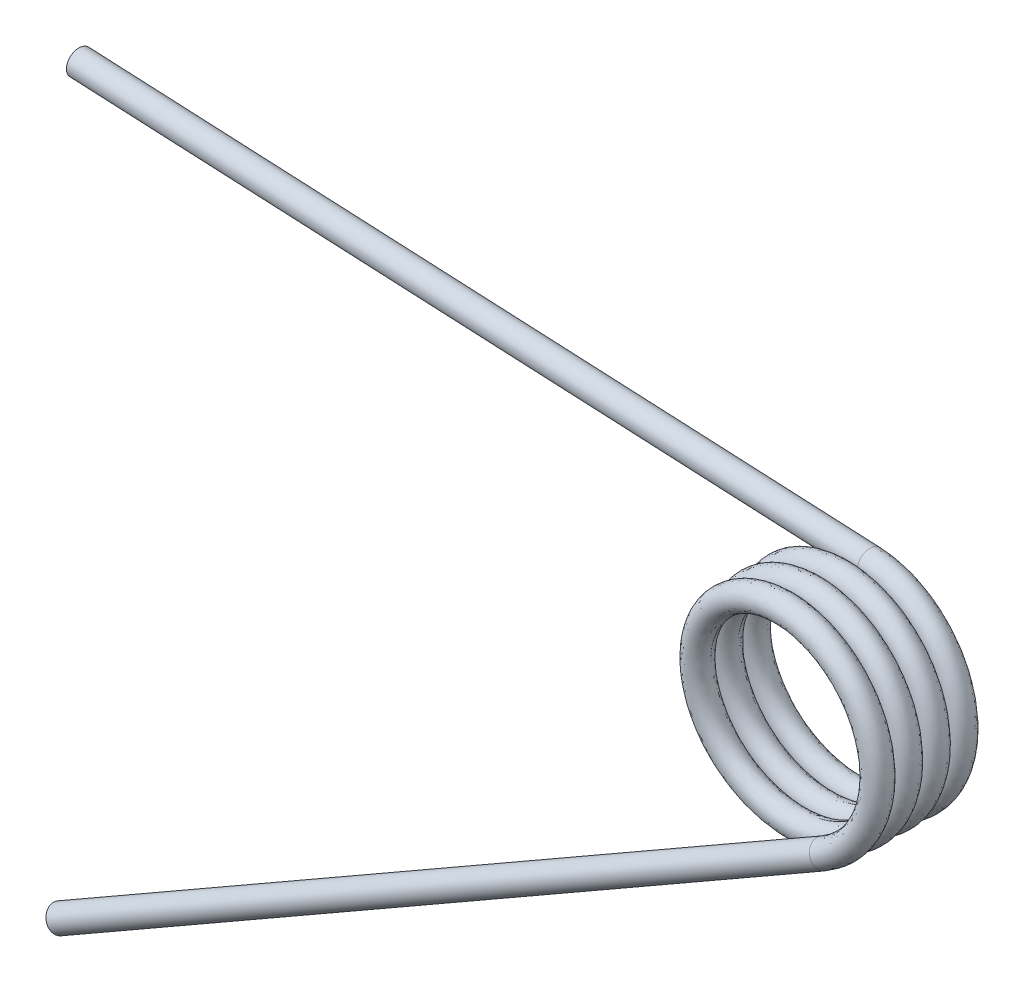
ISO-10303-21;
HEADER;
FILE_DESCRIPTION(('STEP AP214'),'2;1');
FILE_NAME('part.step','',(''),(''),'','','');
FILE_SCHEMA(('AUTOMOTIVE_DESIGN { 1 0 10303 214 1 1 1 1 }'));
ENDSEC;
DATA;
#1=APPLICATION_CONTEXT('core data for automotive mechanical design processes');
#2=APPLICATION_PROTOCOL_DEFINITION('international standard','automotive_design',2000,#1);
#3=PRODUCT_CONTEXT('',#1,'mechanical');
#4=PRODUCT('Part','Part','',(#3));
#5=PRODUCT_RELATED_PRODUCT_CATEGORY('part','',(#4));
#6=PRODUCT_DEFINITION_FORMATION('','',#4);
#7=PRODUCT_DEFINITION_CONTEXT('part definition',#1,'design');
#8=PRODUCT_DEFINITION('design','',#6,#7);
#9=PRODUCT_DEFINITION_SHAPE('','',#8);
#10=(LENGTH_UNIT() NAMED_UNIT(*) SI_UNIT(.MILLI.,.METRE.));
#11=(NAMED_UNIT(*) PLANE_ANGLE_UNIT() SI_UNIT($,.RADIAN.));
#12=(NAMED_UNIT(*) SI_UNIT($,.STERADIAN.) SOLID_ANGLE_UNIT());
#13=UNCERTAINTY_MEASURE_WITH_UNIT(LENGTH_MEASURE(1.E-05),#10,'distance_accuracy_value','');
#14=(GEOMETRIC_REPRESENTATION_CONTEXT(3) GLOBAL_UNCERTAINTY_ASSIGNED_CONTEXT((#13)) GLOBAL_UNIT_ASSIGNED_CONTEXT((#10,
#11,#12)) REPRESENTATION_CONTEXT('',''));
#15=CARTESIAN_POINT('',(0.,0.,0.));
#16=DIRECTION('',(0.,0.,1.));
#17=DIRECTION('',(1.,0.,0.));
#18=AXIS2_PLACEMENT_3D('',#15,#16,#17);
#19=CARTESIAN_POINT('',(0.0204416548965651,3.5,-0.449535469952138));
#20=CARTESIAN_POINT('',(1.4701891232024,3.49153278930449,-0.387035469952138));
#21=CARTESIAN_POINT('',(2.48932816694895,2.46041930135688,-0.324535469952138));
#22=CARTESIAN_POINT('',(3.50846721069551,1.42930581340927,-0.262035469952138));
#23=CARTESIAN_POINT('',(3.5,-0.0204416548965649,-0.199535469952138));
#24=CARTESIAN_POINT('',(3.49153278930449,-1.4701891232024,-0.137035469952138));
#25=CARTESIAN_POINT('',(2.46041930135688,-2.48932816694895,-0.0745354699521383));
#26=CARTESIAN_POINT('',(1.42930581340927,-3.50846721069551,-0.0120354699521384));
#27=CARTESIAN_POINT('',(-0.0204416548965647,-3.5,0.0504645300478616));
#28=CARTESIAN_POINT('',(-1.4701891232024,-3.49153278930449,0.112964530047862));
#29=CARTESIAN_POINT('',(-2.48932816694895,-2.46041930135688,0.175464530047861));
#30=CARTESIAN_POINT('',(-3.50846721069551,-1.42930581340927,0.237964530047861));
#31=CARTESIAN_POINT('',(-3.5,0.0204416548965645,0.300464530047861));
#32=CARTESIAN_POINT('',(-3.49153278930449,1.4701891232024,0.362964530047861));
#33=CARTESIAN_POINT('',(-2.46041930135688,2.48932816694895,0.425464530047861));
#34=CARTESIAN_POINT('',(-1.42930581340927,3.50846721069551,0.487964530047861));
#35=CARTESIAN_POINT('',(0.0204416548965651,3.5,0.550464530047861));
#36=CARTESIAN_POINT('',(1.4701891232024,3.49153278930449,0.612964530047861));
#37=CARTESIAN_POINT('',(2.48932816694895,2.46041930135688,0.675464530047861));
#38=CARTESIAN_POINT('',(3.50846721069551,1.42930581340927,0.737964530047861));
#39=CARTESIAN_POINT('',(3.5,-0.0204416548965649,0.800464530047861));
#40=CARTESIAN_POINT('',(3.49153278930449,-1.4701891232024,0.862964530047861));
#41=CARTESIAN_POINT('',(2.46041930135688,-2.48932816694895,0.925464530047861));
#42=CARTESIAN_POINT('',(1.42930581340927,-3.50846721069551,0.987964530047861));
#43=CARTESIAN_POINT('',(-0.0204416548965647,-3.5,1.05046453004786));
#44=CARTESIAN_POINT('',(-1.4701891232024,-3.49153278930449,1.11296453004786));
#45=CARTESIAN_POINT('',(-2.48932816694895,-2.46041930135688,1.17546453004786));
#46=CARTESIAN_POINT('',(-3.50846721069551,-1.42930581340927,1.23796453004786));
#47=CARTESIAN_POINT('',(-3.5,0.0204416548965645,1.30046453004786));
#48=CARTESIAN_POINT('',(-3.49153278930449,1.4701891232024,1.36296453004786));
#49=CARTESIAN_POINT('',(-2.46041930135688,2.48932816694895,1.42546453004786));
#50=CARTESIAN_POINT('',(-1.42930581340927,3.50846721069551,1.48796453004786));
#51=CARTESIAN_POINT('',(0.0204416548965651,3.5,1.55046453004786));
#52=CARTESIAN_POINT('',(1.4701891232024,3.49153278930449,1.61296453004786));
#53=CARTESIAN_POINT('',(2.48932816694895,2.46041930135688,1.67546453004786));
#54=CARTESIAN_POINT('',(3.50846721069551,1.42930581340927,1.73796453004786));
#55=CARTESIAN_POINT('',(3.5,-0.0204416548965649,1.80046453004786));
#56=CARTESIAN_POINT('',(3.49153278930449,-1.4701891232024,1.86296453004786));
#57=CARTESIAN_POINT('',(2.46041930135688,-2.48932816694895,1.92546453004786));
#58=CARTESIAN_POINT('',(1.42930581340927,-3.50846721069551,1.98796453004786));
#59=CARTESIAN_POINT('',(-0.0204416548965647,-3.5,2.05046453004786));
#60=CARTESIAN_POINT('',(-1.4701891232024,-3.49153278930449,2.11296453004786));
#61=CARTESIAN_POINT('',(-2.48932816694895,-2.46041930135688,2.17546453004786));
#62=CARTESIAN_POINT('',(-3.50846721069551,-1.42930581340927,2.23796453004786));
#63=CARTESIAN_POINT('',(-3.5,0.0204416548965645,2.30046453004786));
#64=CARTESIAN_POINT('',(-3.49153278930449,1.4701891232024,2.36296453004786));
#65=CARTESIAN_POINT('',(-2.46041930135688,2.48932816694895,2.42546453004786));
#66=CARTESIAN_POINT('',(-1.42930581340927,3.50846721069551,2.48796453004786));
#67=CARTESIAN_POINT('',(0.0204416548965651,3.5,2.55046453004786));
#68=CARTESIAN_POINT('',(1.4701891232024,3.49153278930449,2.61296453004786));
#69=CARTESIAN_POINT('',(2.48932816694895,2.46041930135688,2.67546453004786));
#70=CARTESIAN_POINT('',(3.50846721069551,1.42930581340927,2.73796453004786));
#71=CARTESIAN_POINT('',(3.5,-0.0204416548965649,2.80046453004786));
#72=CARTESIAN_POINT('',(3.49153278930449,-1.4701891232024,2.86296453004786));
#73=CARTESIAN_POINT('',(2.46041930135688,-2.48932816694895,2.92546453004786));
#74=CARTESIAN_POINT('',(2.10781179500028,-2.83784080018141,2.94683751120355));
#75=CARTESIAN_POINT('',(1.67228545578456,-3.07471611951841,2.96982838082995));
#76=CARTESIAN_POINT('',(0.0204416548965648,3.61771243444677,-0.449535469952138));
#77=CARTESIAN_POINT('',(1.5189472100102,3.60924522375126,-0.387035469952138));
#78=CARTESIAN_POINT('',(2.57256342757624,2.54365456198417,-0.324535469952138));
#79=CARTESIAN_POINT('',(3.62617964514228,1.47806390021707,-0.262035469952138));
#80=CARTESIAN_POINT('',(3.61771243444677,-0.0204416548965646,-0.199535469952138));
#81=CARTESIAN_POINT('',(3.60924522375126,-1.5189472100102,-0.137035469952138));
#82=CARTESIAN_POINT('',(2.54365456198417,-2.57256342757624,-0.0745354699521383));
#83=CARTESIAN_POINT('',(1.47806390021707,-3.62617964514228,-0.0120354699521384));
#84=CARTESIAN_POINT('',(-0.0204416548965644,-3.61771243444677,0.0504645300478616));
#85=CARTESIAN_POINT('',(-1.5189472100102,-3.60924522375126,0.112964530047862));
#86=CARTESIAN_POINT('',(-2.57256342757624,-2.54365456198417,0.175464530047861));
#87=CARTESIAN_POINT('',(-3.62617964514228,-1.47806390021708,0.237964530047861));
#88=CARTESIAN_POINT('',(-3.61771243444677,0.0204416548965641,0.300464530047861));
#89=CARTESIAN_POINT('',(-3.60924522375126,1.51894721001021,0.362964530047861));
#90=CARTESIAN_POINT('',(-2.54365456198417,2.57256342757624,0.425464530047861));
#91=CARTESIAN_POINT('',(-1.47806390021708,3.62617964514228,0.487964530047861));
#92=CARTESIAN_POINT('',(0.0204416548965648,3.61771243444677,0.550464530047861));
#93=CARTESIAN_POINT('',(1.5189472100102,3.60924522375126,0.612964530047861));
#94=CARTESIAN_POINT('',(2.57256342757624,2.54365456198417,0.675464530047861));
#95=CARTESIAN_POINT('',(3.62617964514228,1.47806390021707,0.737964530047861));
#96=CARTESIAN_POINT('',(3.61771243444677,-0.0204416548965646,0.800464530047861));
#97=CARTESIAN_POINT('',(3.60924522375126,-1.5189472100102,0.862964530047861));
#98=CARTESIAN_POINT('',(2.54365456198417,-2.57256342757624,0.925464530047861));
#99=CARTESIAN_POINT('',(1.47806390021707,-3.62617964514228,0.987964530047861));
#100=CARTESIAN_POINT('',(-0.0204416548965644,-3.61771243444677,1.05046453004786));
#101=CARTESIAN_POINT('',(-1.5189472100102,-3.60924522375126,1.11296453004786));
#102=CARTESIAN_POINT('',(-2.57256342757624,-2.54365456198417,1.17546453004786));
#103=CARTESIAN_POINT('',(-3.62617964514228,-1.47806390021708,1.23796453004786));
#104=CARTESIAN_POINT('',(-3.61771243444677,0.0204416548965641,1.30046453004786));
#105=CARTESIAN_POINT('',(-3.60924522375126,1.51894721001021,1.36296453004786));
#106=CARTESIAN_POINT('',(-2.54365456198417,2.57256342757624,1.42546453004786));
#107=CARTESIAN_POINT('',(-1.47806390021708,3.62617964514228,1.48796453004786));
#108=CARTESIAN_POINT('',(0.0204416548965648,3.61771243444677,1.55046453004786));
#109=CARTESIAN_POINT('',(1.5189472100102,3.60924522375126,1.61296453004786));
#110=CARTESIAN_POINT('',(2.57256342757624,2.54365456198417,1.67546453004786));
#111=CARTESIAN_POINT('',(3.62617964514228,1.47806390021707,1.73796453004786));
#112=CARTESIAN_POINT('',(3.61771243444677,-0.0204416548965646,1.80046453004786));
#113=CARTESIAN_POINT('',(3.60924522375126,-1.5189472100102,1.86296453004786));
#114=CARTESIAN_POINT('',(2.54365456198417,-2.57256342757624,1.92546453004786));
#115=CARTESIAN_POINT('',(1.47806390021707,-3.62617964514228,1.98796453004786));
#116=CARTESIAN_POINT('',(-0.0204416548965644,-3.61771243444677,2.05046453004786));
#117=CARTESIAN_POINT('',(-1.5189472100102,-3.60924522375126,2.11296453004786));
#118=CARTESIAN_POINT('',(-2.57256342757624,-2.54365456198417,2.17546453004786));
#119=CARTESIAN_POINT('',(-3.62617964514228,-1.47806390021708,2.23796453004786));
#120=CARTESIAN_POINT('',(-3.61771243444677,0.0204416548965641,2.30046453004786));
#121=CARTESIAN_POINT('',(-3.60924522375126,1.51894721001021,2.36296453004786));
#122=CARTESIAN_POINT('',(-2.54365456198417,2.57256342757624,2.42546453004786));
#123=CARTESIAN_POINT('',(-1.47806390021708,3.62617964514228,2.48796453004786));
#124=CARTESIAN_POINT('',(0.0204416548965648,3.61771243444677,2.55046453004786));
#125=CARTESIAN_POINT('',(1.5189472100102,3.60924522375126,2.61296453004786));
#126=CARTESIAN_POINT('',(2.57256342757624,2.54365456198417,2.67546453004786));
#127=CARTESIAN_POINT('',(3.62617964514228,1.47806390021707,2.73796453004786));
#128=CARTESIAN_POINT('',(3.61771243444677,-0.0204416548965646,2.80046453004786));
#129=CARTESIAN_POINT('',(3.60924522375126,-1.5189472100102,2.86296453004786));
#130=CARTESIAN_POINT('',(2.54365456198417,-2.57256342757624,2.92546453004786));
#131=CARTESIAN_POINT('',(2.17925697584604,-2.93286614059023,2.94683751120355));
#132=CARTESIAN_POINT('',(1.72912998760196,-3.17779335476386,2.96982838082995));
#133=CARTESIAN_POINT('',(0.0173657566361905,3.95,-0.381892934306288));
#134=CARTESIAN_POINT('',(1.65350932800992,3.94280686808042,-0.319392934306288));
#135=CARTESIAN_POINT('',(2.80535122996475,2.78079234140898,-0.256892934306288));
#136=CARTESIAN_POINT('',(3.95719313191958,1.61877781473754,-0.194392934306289));
#137=CARTESIAN_POINT('',(3.95,-0.0173657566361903,-0.131892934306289));
#138=CARTESIAN_POINT('',(3.94280686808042,-1.65350932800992,-0.0693929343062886));
#139=CARTESIAN_POINT('',(2.78079234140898,-2.80535122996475,-0.00689293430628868));
#140=CARTESIAN_POINT('',(1.61877781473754,-3.95719313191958,0.0556070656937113));
#141=CARTESIAN_POINT('',(-0.0173657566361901,-3.95,0.118107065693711));
#142=CARTESIAN_POINT('',(-1.65350932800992,-3.94280686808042,0.180607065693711));
#143=CARTESIAN_POINT('',(-2.80535122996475,-2.78079234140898,0.243107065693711));
#144=CARTESIAN_POINT('',(-3.95719313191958,-1.61877781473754,0.305607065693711));
#145=CARTESIAN_POINT('',(-3.95,0.0173657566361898,0.368107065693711));
#146=CARTESIAN_POINT('',(-3.94280686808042,1.65350932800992,0.430607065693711));
#147=CARTESIAN_POINT('',(-2.78079234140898,2.80535122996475,0.493107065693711));
#148=CARTESIAN_POINT('',(-1.61877781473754,3.95719313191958,0.555607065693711));
#149=CARTESIAN_POINT('',(0.0173657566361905,3.95,0.618107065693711));
#150=CARTESIAN_POINT('',(1.65350932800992,3.94280686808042,0.680607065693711));
#151=CARTESIAN_POINT('',(2.80535122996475,2.78079234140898,0.743107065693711));
#152=CARTESIAN_POINT('',(3.95719313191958,1.61877781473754,0.805607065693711));
#153=CARTESIAN_POINT('',(3.95,-0.0173657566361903,0.868107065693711));
#154=CARTESIAN_POINT('',(3.94280686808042,-1.65350932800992,0.930607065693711));
#155=CARTESIAN_POINT('',(2.78079234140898,-2.80535122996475,0.99310706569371));
#156=CARTESIAN_POINT('',(1.61877781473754,-3.95719313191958,1.05560706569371));
#157=CARTESIAN_POINT('',(-0.0173657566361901,-3.95,1.11810706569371));
#158=CARTESIAN_POINT('',(-1.65350932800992,-3.94280686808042,1.18060706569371));
#159=CARTESIAN_POINT('',(-2.80535122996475,-2.78079234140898,1.24310706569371));
#160=CARTESIAN_POINT('',(-3.95719313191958,-1.61877781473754,1.30560706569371));
#161=CARTESIAN_POINT('',(-3.95,0.0173657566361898,1.36810706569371));
#162=CARTESIAN_POINT('',(-3.94280686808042,1.65350932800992,1.43060706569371));
#163=CARTESIAN_POINT('',(-2.78079234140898,2.80535122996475,1.49310706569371));
#164=CARTESIAN_POINT('',(-1.61877781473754,3.95719313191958,1.55560706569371));
#165=CARTESIAN_POINT('',(0.0173657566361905,3.95,1.61810706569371));
#166=CARTESIAN_POINT('',(1.65350932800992,3.94280686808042,1.68060706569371));
#167=CARTESIAN_POINT('',(2.80535122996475,2.78079234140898,1.74310706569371));
#168=CARTESIAN_POINT('',(3.95719313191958,1.61877781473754,1.80560706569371));
#169=CARTESIAN_POINT('',(3.95,-0.0173657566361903,1.86810706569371));
#170=CARTESIAN_POINT('',(3.94280686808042,-1.65350932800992,1.93060706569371));
#171=CARTESIAN_POINT('',(2.78079234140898,-2.80535122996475,1.99310706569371));
#172=CARTESIAN_POINT('',(1.61877781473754,-3.95719313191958,2.05560706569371));
#173=CARTESIAN_POINT('',(-0.0173657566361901,-3.95,2.11810706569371));
#174=CARTESIAN_POINT('',(-1.65350932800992,-3.94280686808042,2.18060706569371));
#175=CARTESIAN_POINT('',(-2.80535122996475,-2.78079234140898,2.24310706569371));
#176=CARTESIAN_POINT('',(-3.95719313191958,-1.61877781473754,2.30560706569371));
#177=CARTESIAN_POINT('',(-3.95,0.0173657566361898,2.36810706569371));
#178=CARTESIAN_POINT('',(-3.94280686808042,1.65350932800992,2.43060706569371));
#179=CARTESIAN_POINT('',(-2.78079234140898,2.80535122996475,2.49310706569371));
#180=CARTESIAN_POINT('',(-1.61877781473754,3.95719313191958,2.55560706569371));
#181=CARTESIAN_POINT('',(0.0173657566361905,3.95,2.61810706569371));
#182=CARTESIAN_POINT('',(1.65350932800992,3.94280686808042,2.68060706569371));
#183=CARTESIAN_POINT('',(2.80535122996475,2.78079234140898,2.74310706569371));
#184=CARTESIAN_POINT('',(3.95719313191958,1.61877781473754,2.80560706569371));
#185=CARTESIAN_POINT('',(3.95,-0.0173657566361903,2.86810706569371));
#186=CARTESIAN_POINT('',(3.94280686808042,-1.65350932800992,2.93060706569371));
#187=CARTESIAN_POINT('',(2.78079234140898,-2.80535122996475,2.99310706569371));
#188=CARTESIAN_POINT('',(2.38342090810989,-3.19924395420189,3.0144800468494));
#189=CARTESIAN_POINT('',(1.89228850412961,-3.4672821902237,3.0374709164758));
#190=CARTESIAN_POINT('',(-0.0173657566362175,3.95,0.381892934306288));
#191=CARTESIAN_POINT('',(1.61877781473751,3.95719313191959,0.444392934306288));
#192=CARTESIAN_POINT('',(2.78079234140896,2.80535122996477,0.506892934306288));
#193=CARTESIAN_POINT('',(3.94280686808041,1.65350932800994,0.569392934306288));
#194=CARTESIAN_POINT('',(3.95,0.0173657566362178,0.631892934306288));
#195=CARTESIAN_POINT('',(3.95719313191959,-1.61877781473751,0.694392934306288));
#196=CARTESIAN_POINT('',(2.80535122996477,-2.78079234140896,0.756892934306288));
#197=CARTESIAN_POINT('',(1.65350932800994,-3.94280686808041,0.819392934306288));
#198=CARTESIAN_POINT('',(0.017365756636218,-3.95,0.881892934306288));
#199=CARTESIAN_POINT('',(-1.61877781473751,-3.95719313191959,0.944392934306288));
#200=CARTESIAN_POINT('',(-2.78079234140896,-2.80535122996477,1.00689293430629));
#201=CARTESIAN_POINT('',(-3.94280686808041,-1.65350932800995,1.06939293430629));
#202=CARTESIAN_POINT('',(-3.95,-0.0173657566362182,1.13189293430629));
#203=CARTESIAN_POINT('',(-3.95719313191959,1.61877781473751,1.19439293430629));
#204=CARTESIAN_POINT('',(-2.80535122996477,2.78079234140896,1.25689293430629));
#205=CARTESIAN_POINT('',(-1.65350932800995,3.94280686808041,1.31939293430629));
#206=CARTESIAN_POINT('',(-0.0173657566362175,3.95,1.38189293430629));
#207=CARTESIAN_POINT('',(1.61877781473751,3.95719313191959,1.44439293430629));
#208=CARTESIAN_POINT('',(2.78079234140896,2.80535122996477,1.50689293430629));
#209=CARTESIAN_POINT('',(3.94280686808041,1.65350932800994,1.56939293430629));
#210=CARTESIAN_POINT('',(3.95,0.0173657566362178,1.63189293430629));
#211=CARTESIAN_POINT('',(3.95719313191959,-1.61877781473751,1.69439293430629));
#212=CARTESIAN_POINT('',(2.80535122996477,-2.78079234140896,1.75689293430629));
#213=CARTESIAN_POINT('',(1.65350932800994,-3.94280686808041,1.81939293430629));
#214=CARTESIAN_POINT('',(0.017365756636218,-3.95,1.88189293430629));
#215=CARTESIAN_POINT('',(-1.61877781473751,-3.95719313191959,1.94439293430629));
#216=CARTESIAN_POINT('',(-2.78079234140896,-2.80535122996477,2.00689293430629));
#217=CARTESIAN_POINT('',(-3.94280686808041,-1.65350932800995,2.06939293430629));
#218=CARTESIAN_POINT('',(-3.95,-0.0173657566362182,2.13189293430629));
#219=CARTESIAN_POINT('',(-3.95719313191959,1.61877781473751,2.19439293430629));
#220=CARTESIAN_POINT('',(-2.80535122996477,2.78079234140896,2.25689293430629));
#221=CARTESIAN_POINT('',(-1.65350932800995,3.94280686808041,2.31939293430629));
#222=CARTESIAN_POINT('',(-0.0173657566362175,3.95,2.38189293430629));
#223=CARTESIAN_POINT('',(1.61877781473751,3.95719313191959,2.44439293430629));
#224=CARTESIAN_POINT('',(2.78079234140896,2.80535122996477,2.50689293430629));
#225=CARTESIAN_POINT('',(3.94280686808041,1.65350932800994,2.56939293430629));
#226=CARTESIAN_POINT('',(3.95,0.0173657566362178,2.63189293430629));
#227=CARTESIAN_POINT('',(3.95719313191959,-1.61877781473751,2.69439293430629));
#228=CARTESIAN_POINT('',(2.80535122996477,-2.78079234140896,2.75689293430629));
#229=CARTESIAN_POINT('',(1.65350932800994,-3.94280686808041,2.81939293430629));
#230=CARTESIAN_POINT('',(0.017365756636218,-3.95,2.88189293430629));
#231=CARTESIAN_POINT('',(-1.61877781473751,-3.95719313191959,2.94439293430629));
#232=CARTESIAN_POINT('',(-2.78079234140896,-2.80535122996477,3.00689293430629));
#233=CARTESIAN_POINT('',(-3.94280686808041,-1.65350932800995,3.06939293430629));
#234=CARTESIAN_POINT('',(-3.95,-0.0173657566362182,3.13189293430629));
#235=CARTESIAN_POINT('',(-3.95719313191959,1.61877781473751,3.19439293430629));
#236=CARTESIAN_POINT('',(-2.80535122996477,2.78079234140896,3.25689293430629));
#237=CARTESIAN_POINT('',(-1.65350932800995,3.94280686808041,3.31939293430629));
#238=CARTESIAN_POINT('',(-0.0173657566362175,3.95,3.38189293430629));
#239=CARTESIAN_POINT('',(1.61877781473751,3.95719313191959,3.44439293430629));
#240=CARTESIAN_POINT('',(2.78079234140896,2.80535122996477,3.50689293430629));
#241=CARTESIAN_POINT('',(3.94280686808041,1.65350932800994,3.56939293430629));
#242=CARTESIAN_POINT('',(3.95,0.0173657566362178,3.63189293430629));
#243=CARTESIAN_POINT('',(3.95719313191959,-1.61877781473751,3.69439293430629));
#244=CARTESIAN_POINT('',(2.80535122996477,-2.78079234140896,3.75689293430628));
#245=CARTESIAN_POINT('',(2.41145850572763,-3.17816377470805,3.77826591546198));
#246=CARTESIAN_POINT('',(1.92270184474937,-3.45050998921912,3.80125678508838));
#247=CARTESIAN_POINT('',(-0.0204416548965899,3.61771243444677,0.449535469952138));
#248=CARTESIAN_POINT('',(1.47806390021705,3.62617964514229,0.512035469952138));
#249=CARTESIAN_POINT('',(2.54365456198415,2.57256342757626,0.574535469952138));
#250=CARTESIAN_POINT('',(3.60924522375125,1.51894721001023,0.637035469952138));
#251=CARTESIAN_POINT('',(3.61771243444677,0.0204416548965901,0.699535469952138));
#252=CARTESIAN_POINT('',(3.62617964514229,-1.47806390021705,0.762035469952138));
#253=CARTESIAN_POINT('',(2.57256342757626,-2.54365456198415,0.824535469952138));
#254=CARTESIAN_POINT('',(1.51894721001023,-3.60924522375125,0.887035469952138));
#255=CARTESIAN_POINT('',(0.0204416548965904,-3.61771243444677,0.949535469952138));
#256=CARTESIAN_POINT('',(-1.47806390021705,-3.62617964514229,1.01203546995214));
#257=CARTESIAN_POINT('',(-2.54365456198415,-2.57256342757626,1.07453546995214));
#258=CARTESIAN_POINT('',(-3.60924522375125,-1.51894721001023,1.13703546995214));
#259=CARTESIAN_POINT('',(-3.61771243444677,-0.0204416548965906,1.19953546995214));
#260=CARTESIAN_POINT('',(-3.62617964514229,1.47806390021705,1.26203546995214));
#261=CARTESIAN_POINT('',(-2.57256342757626,2.54365456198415,1.32453546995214));
#262=CARTESIAN_POINT('',(-1.51894721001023,3.60924522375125,1.38703546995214));
#263=CARTESIAN_POINT('',(-0.0204416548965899,3.61771243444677,1.44953546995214));
#264=CARTESIAN_POINT('',(1.47806390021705,3.62617964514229,1.51203546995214));
#265=CARTESIAN_POINT('',(2.54365456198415,2.57256342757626,1.57453546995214));
#266=CARTESIAN_POINT('',(3.60924522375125,1.51894721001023,1.63703546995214));
#267=CARTESIAN_POINT('',(3.61771243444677,0.0204416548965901,1.69953546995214));
#268=CARTESIAN_POINT('',(3.62617964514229,-1.47806390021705,1.76203546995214));
#269=CARTESIAN_POINT('',(2.57256342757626,-2.54365456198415,1.82453546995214));
#270=CARTESIAN_POINT('',(1.51894721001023,-3.60924522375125,1.88703546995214));
#271=CARTESIAN_POINT('',(0.0204416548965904,-3.61771243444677,1.94953546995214));
#272=CARTESIAN_POINT('',(-1.47806390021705,-3.62617964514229,2.01203546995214));
#273=CARTESIAN_POINT('',(-2.54365456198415,-2.57256342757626,2.07453546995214));
#274=CARTESIAN_POINT('',(-3.60924522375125,-1.51894721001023,2.13703546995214));
#275=CARTESIAN_POINT('',(-3.61771243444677,-0.0204416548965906,2.19953546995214));
#276=CARTESIAN_POINT('',(-3.62617964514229,1.47806390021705,2.26203546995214));
#277=CARTESIAN_POINT('',(-2.57256342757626,2.54365456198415,2.32453546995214));
#278=CARTESIAN_POINT('',(-1.51894721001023,3.60924522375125,2.38703546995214));
#279=CARTESIAN_POINT('',(-0.0204416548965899,3.61771243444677,2.44953546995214));
#280=CARTESIAN_POINT('',(1.47806390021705,3.62617964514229,2.51203546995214));
#281=CARTESIAN_POINT('',(2.54365456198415,2.57256342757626,2.57453546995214));
#282=CARTESIAN_POINT('',(3.60924522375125,1.51894721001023,2.63703546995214));
#283=CARTESIAN_POINT('',(3.61771243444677,0.0204416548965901,2.69953546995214));
#284=CARTESIAN_POINT('',(3.62617964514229,-1.47806390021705,2.76203546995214));
#285=CARTESIAN_POINT('',(2.57256342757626,-2.54365456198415,2.82453546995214));
#286=CARTESIAN_POINT('',(1.51894721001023,-3.60924522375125,2.88703546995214));
#287=CARTESIAN_POINT('',(0.0204416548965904,-3.61771243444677,2.94953546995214));
#288=CARTESIAN_POINT('',(-1.47806390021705,-3.62617964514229,3.01203546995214));
#289=CARTESIAN_POINT('',(-2.54365456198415,-2.57256342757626,3.07453546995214));
#290=CARTESIAN_POINT('',(-3.60924522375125,-1.51894721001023,3.13703546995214));
#291=CARTESIAN_POINT('',(-3.61771243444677,-0.0204416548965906,3.19953546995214));
#292=CARTESIAN_POINT('',(-3.62617964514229,1.47806390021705,3.26203546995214));
#293=CARTESIAN_POINT('',(-2.57256342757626,2.54365456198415,3.32453546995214));
#294=CARTESIAN_POINT('',(-1.51894721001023,3.60924522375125,3.38703546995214));
#295=CARTESIAN_POINT('',(-0.0204416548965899,3.61771243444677,3.44953546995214));
#296=CARTESIAN_POINT('',(1.47806390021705,3.62617964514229,3.51203546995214));
#297=CARTESIAN_POINT('',(2.54365456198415,2.57256342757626,3.57453546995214));
#298=CARTESIAN_POINT('',(3.60924522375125,1.51894721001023,3.63703546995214));
#299=CARTESIAN_POINT('',(3.61771243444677,0.0204416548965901,3.69953546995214));
#300=CARTESIAN_POINT('',(3.62617964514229,-1.47806390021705,3.76203546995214));
#301=CARTESIAN_POINT('',(2.57256342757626,-2.54365456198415,3.82453546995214));
#302=CARTESIAN_POINT('',(2.21226071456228,-2.90805214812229,3.84590845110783));
#303=CARTESIAN_POINT('',(1.76493027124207,-3.15805038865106,3.86889932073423));
#304=CARTESIAN_POINT('',(-0.0204416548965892,3.38228756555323,0.449535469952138));
#305=CARTESIAN_POINT('',(1.38054772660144,3.39075477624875,0.512035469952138));
#306=CARTESIAN_POINT('',(2.37718404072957,2.40609290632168,0.574535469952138));
#307=CARTESIAN_POINT('',(3.37382035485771,1.42143103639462,0.637035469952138));
#308=CARTESIAN_POINT('',(3.38228756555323,0.0204416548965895,0.699535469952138));
#309=CARTESIAN_POINT('',(3.39075477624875,-1.38054772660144,0.762035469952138));
#310=CARTESIAN_POINT('',(2.40609290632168,-2.37718404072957,0.824535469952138));
#311=CARTESIAN_POINT('',(1.42143103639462,-3.37382035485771,0.887035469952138));
#312=CARTESIAN_POINT('',(0.0204416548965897,-3.38228756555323,0.949535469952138));
#313=CARTESIAN_POINT('',(-1.38054772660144,-3.39075477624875,1.01203546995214));
#314=CARTESIAN_POINT('',(-2.37718404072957,-2.40609290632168,1.07453546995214));
#315=CARTESIAN_POINT('',(-3.37382035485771,-1.42143103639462,1.13703546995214));
#316=CARTESIAN_POINT('',(-3.38228756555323,-0.0204416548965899,1.19953546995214));
#317=CARTESIAN_POINT('',(-3.39075477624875,1.38054772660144,1.26203546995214));
#318=CARTESIAN_POINT('',(-2.40609290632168,2.37718404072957,1.32453546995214));
#319=CARTESIAN_POINT('',(-1.42143103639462,3.37382035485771,1.38703546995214));
#320=CARTESIAN_POINT('',(-0.0204416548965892,3.38228756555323,1.44953546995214));
#321=CARTESIAN_POINT('',(1.38054772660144,3.39075477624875,1.51203546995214));
#322=CARTESIAN_POINT('',(2.37718404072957,2.40609290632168,1.57453546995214));
#323=CARTESIAN_POINT('',(3.37382035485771,1.42143103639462,1.63703546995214));
#324=CARTESIAN_POINT('',(3.38228756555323,0.0204416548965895,1.69953546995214));
#325=CARTESIAN_POINT('',(3.39075477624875,-1.38054772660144,1.76203546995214));
#326=CARTESIAN_POINT('',(2.40609290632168,-2.37718404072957,1.82453546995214));
#327=CARTESIAN_POINT('',(1.42143103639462,-3.37382035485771,1.88703546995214));
#328=CARTESIAN_POINT('',(0.0204416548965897,-3.38228756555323,1.94953546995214));
#329=CARTESIAN_POINT('',(-1.38054772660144,-3.39075477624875,2.01203546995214));
#330=CARTESIAN_POINT('',(-2.37718404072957,-2.40609290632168,2.07453546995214));
#331=CARTESIAN_POINT('',(-3.37382035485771,-1.42143103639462,2.13703546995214));
#332=CARTESIAN_POINT('',(-3.38228756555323,-0.0204416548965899,2.19953546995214));
#333=CARTESIAN_POINT('',(-3.39075477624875,1.38054772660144,2.26203546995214));
#334=CARTESIAN_POINT('',(-2.40609290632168,2.37718404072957,2.32453546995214));
#335=CARTESIAN_POINT('',(-1.42143103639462,3.37382035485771,2.38703546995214));
#336=CARTESIAN_POINT('',(-0.0204416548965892,3.38228756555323,2.44953546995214));
#337=CARTESIAN_POINT('',(1.38054772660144,3.39075477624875,2.51203546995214));
#338=CARTESIAN_POINT('',(2.37718404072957,2.40609290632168,2.57453546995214));
#339=CARTESIAN_POINT('',(3.37382035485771,1.42143103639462,2.63703546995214));
#340=CARTESIAN_POINT('',(3.38228756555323,0.0204416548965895,2.69953546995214));
#341=CARTESIAN_POINT('',(3.39075477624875,-1.38054772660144,2.76203546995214));
#342=CARTESIAN_POINT('',(2.40609290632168,-2.37718404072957,2.82453546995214));
#343=CARTESIAN_POINT('',(1.42143103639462,-3.37382035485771,2.88703546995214));
#344=CARTESIAN_POINT('',(0.0204416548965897,-3.38228756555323,2.94953546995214));
#345=CARTESIAN_POINT('',(-1.38054772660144,-3.39075477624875,3.01203546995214));
#346=CARTESIAN_POINT('',(-2.37718404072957,-2.40609290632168,3.07453546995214));
#347=CARTESIAN_POINT('',(-3.37382035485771,-1.42143103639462,3.13703546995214));
#348=CARTESIAN_POINT('',(-3.38228756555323,-0.0204416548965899,3.19953546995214));
#349=CARTESIAN_POINT('',(-3.39075477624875,1.38054772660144,3.26203546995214));
#350=CARTESIAN_POINT('',(-2.40609290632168,2.37718404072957,3.32453546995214));
#351=CARTESIAN_POINT('',(-1.42143103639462,3.37382035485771,3.38703546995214));
#352=CARTESIAN_POINT('',(-0.0204416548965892,3.38228756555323,3.44953546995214));
#353=CARTESIAN_POINT('',(1.38054772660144,3.39075477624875,3.51203546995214));
#354=CARTESIAN_POINT('',(2.37718404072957,2.40609290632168,3.57453546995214));
#355=CARTESIAN_POINT('',(3.37382035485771,1.42143103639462,3.63703546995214));
#356=CARTESIAN_POINT('',(3.38228756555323,0.0204416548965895,3.69953546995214));
#357=CARTESIAN_POINT('',(3.39075477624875,-1.38054772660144,3.76203546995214));
#358=CARTESIAN_POINT('',(2.40609290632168,-2.37718404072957,3.82453546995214));
#359=CARTESIAN_POINT('',(2.06937035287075,-2.71800146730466,3.84590845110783));
#360=CARTESIAN_POINT('',(1.65124120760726,-2.95189591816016,3.86889932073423));
#361=CARTESIAN_POINT('',(-0.017365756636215,3.05,0.381892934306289));
#362=CARTESIAN_POINT('',(1.24598560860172,3.05719313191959,0.444392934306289));
#363=CARTESIAN_POINT('',(2.14439623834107,2.16895512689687,0.506892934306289));
#364=CARTESIAN_POINT('',(3.04280686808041,1.28071712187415,0.569392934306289));
#365=CARTESIAN_POINT('',(3.05,0.0173657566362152,0.631892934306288));
#366=CARTESIAN_POINT('',(3.05719313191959,-1.24598560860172,0.694392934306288));
#367=CARTESIAN_POINT('',(2.16895512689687,-2.14439623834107,0.756892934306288));
#368=CARTESIAN_POINT('',(1.28071712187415,-3.04280686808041,0.819392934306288));
#369=CARTESIAN_POINT('',(0.0173657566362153,-3.05,0.881892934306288));
#370=CARTESIAN_POINT('',(-1.24598560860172,-3.05719313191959,0.944392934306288));
#371=CARTESIAN_POINT('',(-2.14439623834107,-2.16895512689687,1.00689293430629));
#372=CARTESIAN_POINT('',(-3.04280686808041,-1.28071712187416,1.06939293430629));
#373=CARTESIAN_POINT('',(-3.05,-0.0173657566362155,1.13189293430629));
#374=CARTESIAN_POINT('',(-3.05719313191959,1.24598560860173,1.19439293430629));
#375=CARTESIAN_POINT('',(-2.16895512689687,2.14439623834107,1.25689293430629));
#376=CARTESIAN_POINT('',(-1.28071712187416,3.04280686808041,1.31939293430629));
#377=CARTESIAN_POINT('',(-0.017365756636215,3.05,1.38189293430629));
#378=CARTESIAN_POINT('',(1.24598560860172,3.05719313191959,1.44439293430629));
#379=CARTESIAN_POINT('',(2.14439623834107,2.16895512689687,1.50689293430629));
#380=CARTESIAN_POINT('',(3.04280686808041,1.28071712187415,1.56939293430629));
#381=CARTESIAN_POINT('',(3.05,0.0173657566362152,1.63189293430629));
#382=CARTESIAN_POINT('',(3.05719313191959,-1.24598560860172,1.69439293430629));
#383=CARTESIAN_POINT('',(2.16895512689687,-2.14439623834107,1.75689293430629));
#384=CARTESIAN_POINT('',(1.28071712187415,-3.04280686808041,1.81939293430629));
#385=CARTESIAN_POINT('',(0.0173657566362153,-3.05,1.88189293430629));
#386=CARTESIAN_POINT('',(-1.24598560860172,-3.05719313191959,1.94439293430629));
#387=CARTESIAN_POINT('',(-2.14439623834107,-2.16895512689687,2.00689293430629));
#388=CARTESIAN_POINT('',(-3.04280686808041,-1.28071712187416,2.06939293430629));
#389=CARTESIAN_POINT('',(-3.05,-0.0173657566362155,2.13189293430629));
#390=CARTESIAN_POINT('',(-3.05719313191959,1.24598560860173,2.19439293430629));
#391=CARTESIAN_POINT('',(-2.16895512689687,2.14439623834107,2.25689293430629));
#392=CARTESIAN_POINT('',(-1.28071712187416,3.04280686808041,2.31939293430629));
#393=CARTESIAN_POINT('',(-0.017365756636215,3.05,2.38189293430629));
#394=CARTESIAN_POINT('',(1.24598560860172,3.05719313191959,2.44439293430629));
#395=CARTESIAN_POINT('',(2.14439623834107,2.16895512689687,2.50689293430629));
#396=CARTESIAN_POINT('',(3.04280686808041,1.28071712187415,2.56939293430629));
#397=CARTESIAN_POINT('',(3.05,0.0173657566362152,2.63189293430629));
#398=CARTESIAN_POINT('',(3.05719313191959,-1.24598560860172,2.69439293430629));
#399=CARTESIAN_POINT('',(2.16895512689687,-2.14439623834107,2.75689293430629));
#400=CARTESIAN_POINT('',(1.28071712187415,-3.04280686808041,2.81939293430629));
#401=CARTESIAN_POINT('',(0.0173657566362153,-3.05,2.88189293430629));
#402=CARTESIAN_POINT('',(-1.24598560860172,-3.05719313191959,2.94439293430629));
#403=CARTESIAN_POINT('',(-2.14439623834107,-2.16895512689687,3.00689293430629));
#404=CARTESIAN_POINT('',(-3.04280686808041,-1.28071712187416,3.06939293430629));
#405=CARTESIAN_POINT('',(-3.05,-0.0173657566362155,3.13189293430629));
#406=CARTESIAN_POINT('',(-3.05719313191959,1.24598560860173,3.19439293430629));
#407=CARTESIAN_POINT('',(-2.16895512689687,2.14439623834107,3.25689293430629));
#408=CARTESIAN_POINT('',(-1.28071712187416,3.04280686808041,3.31939293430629));
#409=CARTESIAN_POINT('',(-0.017365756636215,3.05,3.38189293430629));
#410=CARTESIAN_POINT('',(1.24598560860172,3.05719313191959,3.44439293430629));
#411=CARTESIAN_POINT('',(2.14439623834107,2.16895512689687,3.50689293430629));
#412=CARTESIAN_POINT('',(3.04280686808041,1.28071712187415,3.56939293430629));
#413=CARTESIAN_POINT('',(3.05,0.0173657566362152,3.63189293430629));
#414=CARTESIAN_POINT('',(3.05719313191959,-1.24598560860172,3.69439293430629));
#415=CARTESIAN_POINT('',(2.16895512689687,-2.14439623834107,3.75689293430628));
#416=CARTESIAN_POINT('',(1.8652064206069,-2.451623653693,3.77826591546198));
#417=CARTESIAN_POINT('',(1.48808269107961,-2.66240708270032,3.80125678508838));
#418=CARTESIAN_POINT('',(0.0173657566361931,3.05,-0.381892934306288));
#419=CARTESIAN_POINT('',(1.28071712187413,3.04280686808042,-0.319392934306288));
#420=CARTESIAN_POINT('',(2.16895512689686,2.14439623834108,-0.256892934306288));
#421=CARTESIAN_POINT('',(3.05719313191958,1.24598560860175,-0.194392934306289));
#422=CARTESIAN_POINT('',(3.05,-0.0173657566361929,-0.131892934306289));
#423=CARTESIAN_POINT('',(3.04280686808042,-1.28071712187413,-0.0693929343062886));
#424=CARTESIAN_POINT('',(2.14439623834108,-2.16895512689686,-0.00689293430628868));
#425=CARTESIAN_POINT('',(1.24598560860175,-3.05719313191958,0.0556070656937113));
#426=CARTESIAN_POINT('',(-0.0173657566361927,-3.05,0.118107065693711));
#427=CARTESIAN_POINT('',(-1.28071712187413,-3.04280686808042,0.180607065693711));
#428=CARTESIAN_POINT('',(-2.16895512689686,-2.14439623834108,0.243107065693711));
#429=CARTESIAN_POINT('',(-3.05719313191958,-1.24598560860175,0.305607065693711));
#430=CARTESIAN_POINT('',(-3.05,0.0173657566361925,0.368107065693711));
#431=CARTESIAN_POINT('',(-3.04280686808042,1.28071712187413,0.430607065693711));
#432=CARTESIAN_POINT('',(-2.14439623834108,2.16895512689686,0.493107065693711));
#433=CARTESIAN_POINT('',(-1.24598560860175,3.05719313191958,0.555607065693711));
#434=CARTESIAN_POINT('',(0.0173657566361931,3.05,0.618107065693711));
#435=CARTESIAN_POINT('',(1.28071712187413,3.04280686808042,0.680607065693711));
#436=CARTESIAN_POINT('',(2.16895512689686,2.14439623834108,0.743107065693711));
#437=CARTESIAN_POINT('',(3.05719313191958,1.24598560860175,0.805607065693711));
#438=CARTESIAN_POINT('',(3.05,-0.0173657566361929,0.868107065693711));
#439=CARTESIAN_POINT('',(3.04280686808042,-1.28071712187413,0.930607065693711));
#440=CARTESIAN_POINT('',(2.14439623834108,-2.16895512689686,0.99310706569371));
#441=CARTESIAN_POINT('',(1.24598560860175,-3.05719313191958,1.05560706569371));
#442=CARTESIAN_POINT('',(-0.0173657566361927,-3.05,1.11810706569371));
#443=CARTESIAN_POINT('',(-1.28071712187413,-3.04280686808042,1.18060706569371));
#444=CARTESIAN_POINT('',(-2.16895512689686,-2.14439623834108,1.24310706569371));
#445=CARTESIAN_POINT('',(-3.05719313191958,-1.24598560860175,1.30560706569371));
#446=CARTESIAN_POINT('',(-3.05,0.0173657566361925,1.36810706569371));
#447=CARTESIAN_POINT('',(-3.04280686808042,1.28071712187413,1.43060706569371));
#448=CARTESIAN_POINT('',(-2.14439623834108,2.16895512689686,1.49310706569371));
#449=CARTESIAN_POINT('',(-1.24598560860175,3.05719313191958,1.55560706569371));
#450=CARTESIAN_POINT('',(0.0173657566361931,3.05,1.61810706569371));
#451=CARTESIAN_POINT('',(1.28071712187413,3.04280686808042,1.68060706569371));
#452=CARTESIAN_POINT('',(2.16895512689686,2.14439623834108,1.74310706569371));
#453=CARTESIAN_POINT('',(3.05719313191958,1.24598560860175,1.80560706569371));
#454=CARTESIAN_POINT('',(3.05,-0.0173657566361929,1.86810706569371));
#455=CARTESIAN_POINT('',(3.04280686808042,-1.28071712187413,1.93060706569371));
#456=CARTESIAN_POINT('',(2.14439623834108,-2.16895512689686,1.99310706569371));
#457=CARTESIAN_POINT('',(1.24598560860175,-3.05719313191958,2.05560706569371));
#458=CARTESIAN_POINT('',(-0.0173657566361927,-3.05,2.11810706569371));
#459=CARTESIAN_POINT('',(-1.28071712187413,-3.04280686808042,2.18060706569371));
#460=CARTESIAN_POINT('',(-2.16895512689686,-2.14439623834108,2.24310706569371));
#461=CARTESIAN_POINT('',(-3.05719313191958,-1.24598560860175,2.30560706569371));
#462=CARTESIAN_POINT('',(-3.05,0.0173657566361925,2.36810706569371));
#463=CARTESIAN_POINT('',(-3.04280686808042,1.28071712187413,2.43060706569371));
#464=CARTESIAN_POINT('',(-2.14439623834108,2.16895512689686,2.49310706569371));
#465=CARTESIAN_POINT('',(-1.24598560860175,3.05719313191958,2.55560706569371));
#466=CARTESIAN_POINT('',(0.0173657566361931,3.05,2.61810706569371));
#467=CARTESIAN_POINT('',(1.28071712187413,3.04280686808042,2.68060706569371));
#468=CARTESIAN_POINT('',(2.16895512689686,2.14439623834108,2.74310706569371));
#469=CARTESIAN_POINT('',(3.05719313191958,1.24598560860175,2.80560706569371));
#470=CARTESIAN_POINT('',(3.05,-0.0173657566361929,2.86810706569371));
#471=CARTESIAN_POINT('',(3.04280686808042,-1.28071712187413,2.93060706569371));
#472=CARTESIAN_POINT('',(2.14439623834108,-2.16895512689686,2.99310706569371));
#473=CARTESIAN_POINT('',(1.83716882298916,-2.47270383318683,3.0144800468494));
#474=CARTESIAN_POINT('',(1.45766935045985,-2.6791792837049,3.0374709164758));
#475=CARTESIAN_POINT('',(0.0204416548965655,3.38228756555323,-0.449535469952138));
#476=CARTESIAN_POINT('',(1.42143103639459,3.37382035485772,-0.387035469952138));
#477=CARTESIAN_POINT('',(2.40609290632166,2.37718404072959,-0.324535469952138));
#478=CARTESIAN_POINT('',(3.39075477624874,1.38054772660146,-0.262035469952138));
#479=CARTESIAN_POINT('',(3.38228756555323,-0.0204416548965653,-0.199535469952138));
#480=CARTESIAN_POINT('',(3.37382035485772,-1.42143103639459,-0.137035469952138));
#481=CARTESIAN_POINT('',(2.37718404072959,-2.40609290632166,-0.0745354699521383));
#482=CARTESIAN_POINT('',(1.38054772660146,-3.39075477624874,-0.0120354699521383));
#483=CARTESIAN_POINT('',(-0.0204416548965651,-3.38228756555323,0.0504645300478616));
#484=CARTESIAN_POINT('',(-1.42143103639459,-3.37382035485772,0.112964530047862));
#485=CARTESIAN_POINT('',(-2.40609290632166,-2.37718404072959,0.175464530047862));
#486=CARTESIAN_POINT('',(-3.39075477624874,-1.38054772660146,0.237964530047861));
#487=CARTESIAN_POINT('',(-3.38228756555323,0.0204416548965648,0.300464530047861));
#488=CARTESIAN_POINT('',(-3.37382035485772,1.42143103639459,0.362964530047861));
#489=CARTESIAN_POINT('',(-2.37718404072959,2.40609290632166,0.425464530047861));
#490=CARTESIAN_POINT('',(-1.38054772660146,3.39075477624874,0.487964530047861));
#491=CARTESIAN_POINT('',(0.0204416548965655,3.38228756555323,0.550464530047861));
#492=CARTESIAN_POINT('',(1.42143103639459,3.37382035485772,0.612964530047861));
#493=CARTESIAN_POINT('',(2.40609290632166,2.37718404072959,0.675464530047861));
#494=CARTESIAN_POINT('',(3.39075477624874,1.38054772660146,0.737964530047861));
#495=CARTESIAN_POINT('',(3.38228756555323,-0.0204416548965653,0.800464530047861));
#496=CARTESIAN_POINT('',(3.37382035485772,-1.42143103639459,0.862964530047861));
#497=CARTESIAN_POINT('',(2.37718404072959,-2.40609290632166,0.925464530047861));
#498=CARTESIAN_POINT('',(1.38054772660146,-3.39075477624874,0.987964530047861));
#499=CARTESIAN_POINT('',(-0.0204416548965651,-3.38228756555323,1.05046453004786));
#500=CARTESIAN_POINT('',(-1.42143103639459,-3.37382035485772,1.11296453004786));
#501=CARTESIAN_POINT('',(-2.40609290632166,-2.37718404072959,1.17546453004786));
#502=CARTESIAN_POINT('',(-3.39075477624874,-1.38054772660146,1.23796453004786));
#503=CARTESIAN_POINT('',(-3.38228756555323,0.0204416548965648,1.30046453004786));
#504=CARTESIAN_POINT('',(-3.37382035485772,1.42143103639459,1.36296453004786));
#505=CARTESIAN_POINT('',(-2.37718404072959,2.40609290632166,1.42546453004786));
#506=CARTESIAN_POINT('',(-1.38054772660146,3.39075477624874,1.48796453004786));
#507=CARTESIAN_POINT('',(0.0204416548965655,3.38228756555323,1.55046453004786));
#508=CARTESIAN_POINT('',(1.42143103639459,3.37382035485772,1.61296453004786));
#509=CARTESIAN_POINT('',(2.40609290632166,2.37718404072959,1.67546453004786));
#510=CARTESIAN_POINT('',(3.39075477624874,1.38054772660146,1.73796453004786));
#511=CARTESIAN_POINT('',(3.38228756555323,-0.0204416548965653,1.80046453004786));
#512=CARTESIAN_POINT('',(3.37382035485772,-1.42143103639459,1.86296453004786));
#513=CARTESIAN_POINT('',(2.37718404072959,-2.40609290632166,1.92546453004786));
#514=CARTESIAN_POINT('',(1.38054772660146,-3.39075477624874,1.98796453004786));
#515=CARTESIAN_POINT('',(-0.0204416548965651,-3.38228756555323,2.05046453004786));
#516=CARTESIAN_POINT('',(-1.42143103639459,-3.37382035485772,2.11296453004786));
#517=CARTESIAN_POINT('',(-2.40609290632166,-2.37718404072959,2.17546453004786));
#518=CARTESIAN_POINT('',(-3.39075477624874,-1.38054772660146,2.23796453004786));
#519=CARTESIAN_POINT('',(-3.38228756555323,0.0204416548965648,2.30046453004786));
#520=CARTESIAN_POINT('',(-3.37382035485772,1.42143103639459,2.36296453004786));
#521=CARTESIAN_POINT('',(-2.37718404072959,2.40609290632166,2.42546453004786));
#522=CARTESIAN_POINT('',(-1.38054772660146,3.39075477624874,2.48796453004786));
#523=CARTESIAN_POINT('',(0.0204416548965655,3.38228756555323,2.55046453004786));
#524=CARTESIAN_POINT('',(1.42143103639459,3.37382035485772,2.61296453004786));
#525=CARTESIAN_POINT('',(2.40609290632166,2.37718404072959,2.67546453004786));
#526=CARTESIAN_POINT('',(3.39075477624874,1.38054772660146,2.73796453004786));
#527=CARTESIAN_POINT('',(3.38228756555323,-0.0204416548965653,2.80046453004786));
#528=CARTESIAN_POINT('',(3.37382035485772,-1.42143103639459,2.86296453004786));
#529=CARTESIAN_POINT('',(2.37718404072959,-2.40609290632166,2.92546453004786));
#530=CARTESIAN_POINT('',(2.03636661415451,-2.7428154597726,2.94683751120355));
#531=CARTESIAN_POINT('',(1.61544092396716,-2.97163888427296,2.96982838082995));
#532=CARTESIAN_POINT('',(0.0204416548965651,3.5,-0.449535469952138));
#533=CARTESIAN_POINT('',(1.4701891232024,3.49153278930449,-0.387035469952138));
#534=CARTESIAN_POINT('',(2.48932816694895,2.46041930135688,-0.324535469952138));
#535=CARTESIAN_POINT('',(3.50846721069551,1.42930581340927,-0.262035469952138));
#536=CARTESIAN_POINT('',(3.5,-0.0204416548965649,-0.199535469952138));
#537=CARTESIAN_POINT('',(3.49153278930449,-1.4701891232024,-0.137035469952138));
#538=CARTESIAN_POINT('',(2.46041930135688,-2.48932816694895,-0.0745354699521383));
#539=CARTESIAN_POINT('',(1.42930581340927,-3.50846721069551,-0.0120354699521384));
#540=CARTESIAN_POINT('',(-0.0204416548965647,-3.5,0.0504645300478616));
#541=CARTESIAN_POINT('',(-1.4701891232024,-3.49153278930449,0.112964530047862));
#542=CARTESIAN_POINT('',(-2.48932816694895,-2.46041930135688,0.175464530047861));
#543=CARTESIAN_POINT('',(-3.50846721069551,-1.42930581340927,0.237964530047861));
#544=CARTESIAN_POINT('',(-3.5,0.0204416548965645,0.300464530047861));
#545=CARTESIAN_POINT('',(-3.49153278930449,1.4701891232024,0.362964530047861));
#546=CARTESIAN_POINT('',(-2.46041930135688,2.48932816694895,0.425464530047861));
#547=CARTESIAN_POINT('',(-1.42930581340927,3.50846721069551,0.487964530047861));
#548=CARTESIAN_POINT('',(0.0204416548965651,3.5,0.550464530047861));
#549=CARTESIAN_POINT('',(1.4701891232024,3.49153278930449,0.612964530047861));
#550=CARTESIAN_POINT('',(2.48932816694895,2.46041930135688,0.675464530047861));
#551=CARTESIAN_POINT('',(3.50846721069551,1.42930581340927,0.737964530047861));
#552=CARTESIAN_POINT('',(3.5,-0.0204416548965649,0.800464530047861));
#553=CARTESIAN_POINT('',(3.49153278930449,-1.4701891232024,0.862964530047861));
#554=CARTESIAN_POINT('',(2.46041930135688,-2.48932816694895,0.925464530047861));
#555=CARTESIAN_POINT('',(1.42930581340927,-3.50846721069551,0.987964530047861));
#556=CARTESIAN_POINT('',(-0.0204416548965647,-3.5,1.05046453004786));
#557=CARTESIAN_POINT('',(-1.4701891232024,-3.49153278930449,1.11296453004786));
#558=CARTESIAN_POINT('',(-2.48932816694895,-2.46041930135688,1.17546453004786));
#559=CARTESIAN_POINT('',(-3.50846721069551,-1.42930581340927,1.23796453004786));
#560=CARTESIAN_POINT('',(-3.5,0.0204416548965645,1.30046453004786));
#561=CARTESIAN_POINT('',(-3.49153278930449,1.4701891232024,1.36296453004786));
#562=CARTESIAN_POINT('',(-2.46041930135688,2.48932816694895,1.42546453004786));
#563=CARTESIAN_POINT('',(-1.42930581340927,3.50846721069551,1.48796453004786));
#564=CARTESIAN_POINT('',(0.0204416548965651,3.5,1.55046453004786));
#565=CARTESIAN_POINT('',(1.4701891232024,3.49153278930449,1.61296453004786));
#566=CARTESIAN_POINT('',(2.48932816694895,2.46041930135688,1.67546453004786));
#567=CARTESIAN_POINT('',(3.50846721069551,1.42930581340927,1.73796453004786));
#568=CARTESIAN_POINT('',(3.5,-0.0204416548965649,1.80046453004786));
#569=CARTESIAN_POINT('',(3.49153278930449,-1.4701891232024,1.86296453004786));
#570=CARTESIAN_POINT('',(2.46041930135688,-2.48932816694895,1.92546453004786));
#571=CARTESIAN_POINT('',(1.42930581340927,-3.50846721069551,1.98796453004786));
#572=CARTESIAN_POINT('',(-0.0204416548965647,-3.5,2.05046453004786));
#573=CARTESIAN_POINT('',(-1.4701891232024,-3.49153278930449,2.11296453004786));
#574=CARTESIAN_POINT('',(-2.48932816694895,-2.46041930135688,2.17546453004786));
#575=CARTESIAN_POINT('',(-3.50846721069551,-1.42930581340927,2.23796453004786));
#576=CARTESIAN_POINT('',(-3.5,0.0204416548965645,2.30046453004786));
#577=CARTESIAN_POINT('',(-3.49153278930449,1.4701891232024,2.36296453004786));
#578=CARTESIAN_POINT('',(-2.46041930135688,2.48932816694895,2.42546453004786));
#579=CARTESIAN_POINT('',(-1.42930581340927,3.50846721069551,2.48796453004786));
#580=CARTESIAN_POINT('',(0.0204416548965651,3.5,2.55046453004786));
#581=CARTESIAN_POINT('',(1.4701891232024,3.49153278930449,2.61296453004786));
#582=CARTESIAN_POINT('',(2.48932816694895,2.46041930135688,2.67546453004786));
#583=CARTESIAN_POINT('',(3.50846721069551,1.42930581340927,2.73796453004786));
#584=CARTESIAN_POINT('',(3.5,-0.0204416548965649,2.80046453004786));
#585=CARTESIAN_POINT('',(3.49153278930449,-1.4701891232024,2.86296453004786));
#586=CARTESIAN_POINT('',(2.46041930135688,-2.48932816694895,2.92546453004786));
#587=CARTESIAN_POINT('',(2.10781179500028,-2.83784080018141,2.94683751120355));
#588=CARTESIAN_POINT('',(1.67228545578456,-3.07471611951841,2.96982838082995));
#589=(BOUNDED_SURFACE() B_SPLINE_SURFACE(3,2,((#19,#20,#21,#22,#23,#24,#25,#26,#27,#28,#29,#30,
#31,#32,#33,#34,#35,#36,#37,#38,#39,#40,#41,#42,#43,#44,#45,#46,#47,#48,#49,#50,#51,#52,#53,#54,
#55,#56,#57,#58,#59,#60,#61,#62,#63,#64,#65,#66,#67,#68,#69,#70,#71,#72,#73,#74,#75),(#76,#77,
#78,#79,#80,#81,#82,#83,#84,#85,#86,#87,#88,#89,#90,#91,#92,#93,#94,#95,#96,#97,#98,#99,#100,
#101,#102,#103,#104,#105,#106,#107,#108,#109,#110,#111,#112,#113,#114,#115,#116,#117,#118,#119,
#120,#121,#122,#123,#124,#125,#126,#127,#128,#129,#130,#131,#132),(#133,#134,#135,#136,#137,
#138,#139,#140,#141,#142,#143,#144,#145,#146,#147,#148,#149,#150,#151,#152,#153,#154,#155,#156,
#157,#158,#159,#160,#161,#162,#163,#164,#165,#166,#167,#168,#169,#170,#171,#172,#173,#174,#175,
#176,#177,#178,#179,#180,#181,#182,#183,#184,#185,#186,#187,#188,#189),(#190,#191,#192,#193,
#194,#195,#196,#197,#198,#199,#200,#201,#202,#203,#204,#205,#206,#207,#208,#209,#210,#211,#212,
#213,#214,#215,#216,#217,#218,#219,#220,#221,#222,#223,#224,#225,#226,#227,#228,#229,#230,#231,
#232,#233,#234,#235,#236,#237,#238,#239,#240,#241,#242,#243,#244,#245,#246),(#247,#248,#249,
#250,#251,#252,#253,#254,#255,#256,#257,#258,#259,#260,#261,#262,#263,#264,#265,#266,#267,#268,
#269,#270,#271,#272,#273,#274,#275,#276,#277,#278,#279,#280,#281,#282,#283,#284,#285,#286,#287,
#288,#289,#290,#291,#292,#293,#294,#295,#296,#297,#298,#299,#300,#301,#302,#303),(#304,#305,
#306,#307,#308,#309,#310,#311,#312,#313,#314,#315,#316,#317,#318,#319,#320,#321,#322,#323,#324,
#325,#326,#327,#328,#329,#330,#331,#332,#333,#334,#335,#336,#337,#338,#339,#340,#341,#342,#343,
#344,#345,#346,#347,#348,#349,#350,#351,#352,#353,#354,#355,#356,#357,#358,#359,#360),(#361,
#362,#363,#364,#365,#366,#367,#368,#369,#370,#371,#372,#373,#374,#375,#376,#377,#378,#379,#380,
#381,#382,#383,#384,#385,#386,#387,#388,#389,#390,#391,#392,#393,#394,#395,#396,#397,#398,#399,
#400,#401,#402,#403,#404,#405,#406,#407,#408,#409,#410,#411,#412,#413,#414,#415,#416,#417),
(#418,#419,#420,#421,#422,#423,#424,#425,#426,#427,#428,#429,#430,#431,#432,#433,#434,#435,#436,
#437,#438,#439,#440,#441,#442,#443,#444,#445,#446,#447,#448,#449,#450,#451,#452,#453,#454,#455,
#456,#457,#458,#459,#460,#461,#462,#463,#464,#465,#466,#467,#468,#469,#470,#471,#472,#473,#474),
(#475,#476,#477,#478,#479,#480,#481,#482,#483,#484,#485,#486,#487,#488,#489,#490,#491,#492,#493,
#494,#495,#496,#497,#498,#499,#500,#501,#502,#503,#504,#505,#506,#507,#508,#509,#510,#511,#512,
#513,#514,#515,#516,#517,#518,#519,#520,#521,#522,#523,#524,#525,#526,#527,#528,#529,#530,#531),
(#532,#533,#534,#535,#536,#537,#538,#539,#540,#541,#542,#543,#544,#545,#546,#547,#548,#549,#550,
#551,#552,#553,#554,#555,#556,#557,#558,#559,#560,#561,#562,#563,#564,#565,#566,#567,#568,#569,
#570,#571,#572,#573,#574,#575,#576,#577,#578,#579,#580,#581,#582,#583,#584,#585,#586,#587,
#588)),.UNSPECIFIED.,.T.,.F.,.F.) B_SPLINE_SURFACE_WITH_KNOTS((4,2,2,2,4),(3,2,2,2,2,2,2,2,2,2,
2,2,2,2,2,2,2,2,2,2,2,2,2,2,2,2,2,2,3),(0.,0.25,0.5,0.75,1.),(0.,0.03125,0.0625,0.09375,0.125,
0.15625,0.1875,0.21875,0.25,0.28125,0.3125,0.34375,0.375,0.40625,0.4375,0.46875,0.5,0.53125,
0.5625,0.59375,0.625,0.65625,0.6875,0.71875,0.75,0.78125,0.8125,0.84375,0.855),
.UNSPECIFIED.) GEOMETRIC_REPRESENTATION_ITEM() RATIONAL_B_SPLINE_SURFACE(((1.,0.923879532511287,
1.,0.923879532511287,1.,0.923879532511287,1.,0.923879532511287,1.,0.923879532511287,1.,
0.923879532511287,1.,0.923879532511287,1.,0.923879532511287,1.,0.923879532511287,1.,
0.923879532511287,1.,0.923879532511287,1.,0.923879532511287,1.,0.923879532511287,1.,
0.923879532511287,1.,0.923879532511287,1.,0.923879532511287,1.,0.923879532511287,1.,
0.923879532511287,1.,0.923879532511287,1.,0.923879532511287,1.,0.923879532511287,1.,
0.923879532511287,1.,0.923879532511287,1.,0.923879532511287,1.,0.923879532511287,1.,
0.923879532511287,1.,0.923879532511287,1.,0.972596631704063,0.964923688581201),(1.,
0.923879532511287,1.,0.923879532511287,1.,0.923879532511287,1.,0.923879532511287,1.,
0.923879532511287,1.,0.923879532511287,1.,0.923879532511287,1.,0.923879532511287,1.,
0.923879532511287,1.,0.923879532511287,1.,0.923879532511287,1.,0.923879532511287,1.,
0.923879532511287,1.,0.923879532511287,1.,0.923879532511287,1.,0.923879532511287,1.,
0.923879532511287,1.,0.923879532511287,1.,0.923879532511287,1.,0.923879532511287,1.,
0.923879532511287,1.,0.923879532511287,1.,0.923879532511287,1.,0.923879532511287,1.,
0.923879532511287,1.,0.923879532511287,1.,0.923879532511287,1.,0.972596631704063,
0.964923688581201),(0.68211091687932,0.630188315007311,0.68211091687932,0.630188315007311,
0.68211091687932,0.630188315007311,0.68211091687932,0.630188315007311,0.68211091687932,
0.630188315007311,0.68211091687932,0.630188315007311,0.68211091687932,0.630188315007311,
0.68211091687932,0.630188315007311,0.68211091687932,0.630188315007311,0.68211091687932,
0.630188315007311,0.68211091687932,0.630188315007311,0.68211091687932,0.630188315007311,
0.68211091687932,0.630188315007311,0.68211091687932,0.630188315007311,0.68211091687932,
0.630188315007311,0.68211091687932,0.630188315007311,0.68211091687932,0.630188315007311,
0.68211091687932,0.630188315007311,0.68211091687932,0.630188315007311,0.68211091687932,
0.630188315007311,0.68211091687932,0.630188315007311,0.68211091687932,0.630188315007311,
0.68211091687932,0.630188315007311,0.68211091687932,0.630188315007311,0.68211091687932,
0.630188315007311,0.68211091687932,0.630188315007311,0.68211091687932,0.630188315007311,
0.68211091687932,0.663418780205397,0.658184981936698),(0.68211091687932,0.630188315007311,
0.68211091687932,0.630188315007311,0.68211091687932,0.630188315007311,0.68211091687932,
0.630188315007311,0.68211091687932,0.630188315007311,0.68211091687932,0.630188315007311,
0.68211091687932,0.630188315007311,0.68211091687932,0.630188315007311,0.68211091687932,
0.630188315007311,0.68211091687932,0.630188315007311,0.68211091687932,0.630188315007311,
0.68211091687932,0.630188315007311,0.68211091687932,0.630188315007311,0.68211091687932,
0.630188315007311,0.68211091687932,0.630188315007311,0.68211091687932,0.630188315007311,
0.68211091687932,0.630188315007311,0.68211091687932,0.630188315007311,0.68211091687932,
0.630188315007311,0.68211091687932,0.630188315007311,0.68211091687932,0.630188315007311,
0.68211091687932,0.630188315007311,0.68211091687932,0.630188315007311,0.68211091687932,
0.630188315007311,0.68211091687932,0.630188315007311,0.68211091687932,0.630188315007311,
0.68211091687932,0.630188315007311,0.68211091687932,0.663418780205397,0.658184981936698),(1.,
0.923879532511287,1.,0.923879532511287,1.,0.923879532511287,1.,0.923879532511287,1.,
0.923879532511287,1.,0.923879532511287,1.,0.923879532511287,1.,0.923879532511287,1.,
0.923879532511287,1.,0.923879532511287,1.,0.923879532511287,1.,0.923879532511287,1.,
0.923879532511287,1.,0.923879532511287,1.,0.923879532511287,1.,0.923879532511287,1.,
0.923879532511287,1.,0.923879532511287,1.,0.923879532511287,1.,0.923879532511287,1.,
0.923879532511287,1.,0.923879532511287,1.,0.923879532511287,1.,0.923879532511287,1.,
0.923879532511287,1.,0.923879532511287,1.,0.923879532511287,1.,0.972596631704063,
0.964923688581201),(1.,0.923879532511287,1.,0.923879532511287,1.,0.923879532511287,1.,
0.923879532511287,1.,0.923879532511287,1.,0.923879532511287,1.,0.923879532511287,1.,
0.923879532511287,1.,0.923879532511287,1.,0.923879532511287,1.,0.923879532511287,1.,
0.923879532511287,1.,0.923879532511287,1.,0.923879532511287,1.,0.923879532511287,1.,
0.923879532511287,1.,0.923879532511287,1.,0.923879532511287,1.,0.923879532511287,1.,
0.923879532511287,1.,0.923879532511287,1.,0.923879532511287,1.,0.923879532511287,1.,
0.923879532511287,1.,0.923879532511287,1.,0.923879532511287,1.,0.923879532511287,1.,
0.972596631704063,0.964923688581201),(0.68211091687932,0.630188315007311,0.68211091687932,
0.630188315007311,0.68211091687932,0.630188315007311,0.68211091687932,0.630188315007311,
0.68211091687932,0.630188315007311,0.68211091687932,0.630188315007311,0.68211091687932,
0.630188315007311,0.68211091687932,0.630188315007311,0.68211091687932,0.630188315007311,
0.68211091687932,0.630188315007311,0.68211091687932,0.630188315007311,0.68211091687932,
0.630188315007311,0.68211091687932,0.630188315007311,0.68211091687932,0.630188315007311,
0.68211091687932,0.630188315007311,0.68211091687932,0.630188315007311,0.68211091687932,
0.630188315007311,0.68211091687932,0.630188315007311,0.68211091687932,0.630188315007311,
0.68211091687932,0.630188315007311,0.68211091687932,0.630188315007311,0.68211091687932,
0.630188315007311,0.68211091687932,0.630188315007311,0.68211091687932,0.630188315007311,
0.68211091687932,0.630188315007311,0.68211091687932,0.630188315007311,0.68211091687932,
0.630188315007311,0.68211091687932,0.663418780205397,0.658184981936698),(0.68211091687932,
0.630188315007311,0.68211091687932,0.630188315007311,0.68211091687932,0.630188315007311,
0.68211091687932,0.630188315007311,0.68211091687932,0.630188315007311,0.68211091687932,
0.630188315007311,0.68211091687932,0.630188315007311,0.68211091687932,0.630188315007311,
0.68211091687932,0.630188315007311,0.68211091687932,0.630188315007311,0.68211091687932,
0.630188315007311,0.68211091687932,0.630188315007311,0.68211091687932,0.630188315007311,
0.68211091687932,0.630188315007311,0.68211091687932,0.630188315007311,0.68211091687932,
0.630188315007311,0.68211091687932,0.630188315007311,0.68211091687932,0.630188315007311,
0.68211091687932,0.630188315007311,0.68211091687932,0.630188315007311,0.68211091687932,
0.630188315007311,0.68211091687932,0.630188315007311,0.68211091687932,0.630188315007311,
0.68211091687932,0.630188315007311,0.68211091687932,0.630188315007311,0.68211091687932,
0.630188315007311,0.68211091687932,0.630188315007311,0.68211091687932,0.663418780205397,
0.658184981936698),(1.,0.923879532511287,1.,0.923879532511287,1.,0.923879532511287,1.,
0.923879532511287,1.,0.923879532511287,1.,0.923879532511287,1.,0.923879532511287,1.,
0.923879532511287,1.,0.923879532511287,1.,0.923879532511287,1.,0.923879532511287,1.,
0.923879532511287,1.,0.923879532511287,1.,0.923879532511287,1.,0.923879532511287,1.,
0.923879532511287,1.,0.923879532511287,1.,0.923879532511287,1.,0.923879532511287,1.,
0.923879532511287,1.,0.923879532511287,1.,0.923879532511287,1.,0.923879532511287,1.,
0.923879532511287,1.,0.923879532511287,1.,0.923879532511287,1.,0.923879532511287,1.,
0.972596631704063,0.964923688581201),(1.,0.923879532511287,1.,0.923879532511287,1.,
0.923879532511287,1.,0.923879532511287,1.,0.923879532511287,1.,0.923879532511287,1.,
0.923879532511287,1.,0.923879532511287,1.,0.923879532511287,1.,0.923879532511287,1.,
0.923879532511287,1.,0.923879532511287,1.,0.923879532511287,1.,0.923879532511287,1.,
0.923879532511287,1.,0.923879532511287,1.,0.923879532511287,1.,0.923879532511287,1.,
0.923879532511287,1.,0.923879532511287,1.,0.923879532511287,1.,0.923879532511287,1.,
0.923879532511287,1.,0.923879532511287,1.,0.923879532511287,1.,0.923879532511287,1.,
0.923879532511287,1.,0.972596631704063,0.964923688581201))) REPRESENTATION_ITEM('') SURFACE());
#590=CARTESIAN_POINT('',(0.,3.5,0.));
#591=DIRECTION('',(0.99896771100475,0.,0.0454258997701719));
#592=DIRECTION('',(0.0454258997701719,0.,-0.99896771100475));
#593=AXIS2_PLACEMENT_3D('',#590,#591,#592);
#594=CIRCLE('',#593,0.45);
#595=CARTESIAN_POINT('',(0.0204416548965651,3.5,-0.449535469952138));
#596=VERTEX_POINT('',#595);
#597=EDGE_CURVE('E54',#596,#596,#594,.T.);
#598=CARTESIAN_POINT('',(1.70808573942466,-3.05497315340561,3.86889932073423));
#599=CARTESIAN_POINT('',(1.69603632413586,-3.03312340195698,3.86890277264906));
#600=CARTESIAN_POINT('',(1.68391390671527,-3.01133732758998,3.86682418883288));
#601=CARTESIAN_POINT('',(1.65983317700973,-2.96844801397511,3.85857565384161));
#602=CARTESIAN_POINT('',(1.64787486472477,-2.94734477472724,3.85240570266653));
#603=CARTESIAN_POINT('',(1.62429655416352,-2.90613202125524,3.83602759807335));
#604=CARTESIAN_POINT('',(1.61268349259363,-2.88604021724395,3.82576494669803));
#605=CARTESIAN_POINT('',(1.59028336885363,-2.84770847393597,3.80147956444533));
#606=CARTESIAN_POINT('',(1.57949749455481,-2.82947118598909,3.78745155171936));
#607=CARTESIAN_POINT('',(1.55909124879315,-2.79542387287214,3.75606267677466));
#608=CARTESIAN_POINT('',(1.54946926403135,-2.77961047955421,3.73870651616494));
#609=CARTESIAN_POINT('',(1.53163331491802,-2.75080806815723,3.70111426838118));
#610=CARTESIAN_POINT('',(1.52342133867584,-2.73782303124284,3.68087418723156));
#611=CARTESIAN_POINT('',(1.50866080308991,-2.71508306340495,3.63812350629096));
#612=CARTESIAN_POINT('',(1.50211103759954,-2.70532578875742,3.61561456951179));
#613=CARTESIAN_POINT('',(1.49085265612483,-2.68930475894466,3.5689513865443));
#614=CARTESIAN_POINT('',(1.48614414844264,-2.68304120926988,3.54479704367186));
#615=CARTESIAN_POINT('',(1.47870262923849,-2.67418649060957,3.49553069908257));
#616=CARTESIAN_POINT('',(1.47596955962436,-2.67159521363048,3.47041872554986));
#617=CARTESIAN_POINT('',(1.47255626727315,-2.67015824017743,3.41994929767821));
#618=CARTESIAN_POINT('',(1.47187604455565,-2.67131254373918,3.39459184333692));
#619=CARTESIAN_POINT('',(1.47258777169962,-2.67733406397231,3.3443505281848));
#620=CARTESIAN_POINT('',(1.47397978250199,-2.68220138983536,3.31946668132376));
#621=CARTESIAN_POINT('',(1.47879641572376,-2.69551048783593,3.27088123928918));
#622=CARTESIAN_POINT('',(1.48222091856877,-2.70395204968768,3.2471795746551));
#623=CARTESIAN_POINT('',(1.49100847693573,-2.72417743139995,3.20161298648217));
#624=CARTESIAN_POINT('',(1.49637294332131,-2.73596368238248,3.17974941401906));
#625=CARTESIAN_POINT('',(1.50887873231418,-2.76252215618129,3.13852889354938));
#626=CARTESIAN_POINT('',(1.51601756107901,-2.77729018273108,3.1191684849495));
#627=CARTESIAN_POINT('',(1.53188451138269,-2.80942613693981,3.08344235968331));
#628=CARTESIAN_POINT('',(1.54061482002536,-2.82679763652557,3.06708082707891));
#629=CARTESIAN_POINT('',(1.55939717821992,-2.86360657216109,3.03787078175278));
#630=CARTESIAN_POINT('',(1.56944740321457,-2.88304114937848,3.02501749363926));
#631=CARTESIAN_POINT('',(1.590449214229,-2.92316838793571,3.00330787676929));
#632=CARTESIAN_POINT('',(1.60138666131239,-2.94384031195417,2.99439949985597));
#633=CARTESIAN_POINT('',(1.62397735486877,-2.98610653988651,2.98057144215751));
#634=CARTESIAN_POINT('',(1.63563060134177,-3.00770084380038,2.97565176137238));
#635=CARTESIAN_POINT('',(1.65949575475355,-3.05151778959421,2.96989772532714));
#636=CARTESIAN_POINT('',(1.6717131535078,-3.07374499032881,2.96912071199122));
#637=CARTESIAN_POINT('',(1.69622376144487,-3.11793535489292,2.9718305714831));
#638=CARTESIAN_POINT('',(1.70851705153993,-3.13989811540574,2.97532328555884));
#639=CARTESIAN_POINT('',(1.73279659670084,-3.18287454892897,2.9864752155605));
#640=CARTESIAN_POINT('',(1.74478325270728,-3.20388949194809,2.99412866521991));
#641=CARTESIAN_POINT('',(1.76814382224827,-3.24443544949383,3.01339493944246));
#642=CARTESIAN_POINT('',(1.77951685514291,-3.26396434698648,3.02501328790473));
#643=CARTESIAN_POINT('',(1.80129337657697,-3.3009243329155,3.05185768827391));
#644=CARTESIAN_POINT('',(1.8116981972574,-3.31835831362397,3.06707867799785));
#645=CARTESIAN_POINT('',(1.83127509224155,-3.35068877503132,3.10072929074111));
#646=CARTESIAN_POINT('',(1.84044542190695,-3.365581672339,3.11916337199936));
#647=CARTESIAN_POINT('',(1.85726921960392,-3.39236686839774,3.15868695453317));
#648=CARTESIAN_POINT('',(1.864923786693,-3.40426134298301,3.17977451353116));
#649=CARTESIAN_POINT('',(1.87850757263,-3.42472688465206,3.22401837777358));
#650=CARTESIAN_POINT('',(1.88443669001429,-3.43329775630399,3.24717480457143));
#651=CARTESIAN_POINT('',(1.89440048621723,-3.44687154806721,3.29489723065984));
#652=CARTESIAN_POINT('',(1.8984352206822,-3.45187457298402,3.31946318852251));
#653=CARTESIAN_POINT('',(1.90449598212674,-3.45817107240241,3.36930794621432));
#654=CARTESIAN_POINT('',(1.90652200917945,-3.45946454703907,3.3945867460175));
#655=CARTESIAN_POINT('',(1.90850786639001,-3.45830519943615,3.44514035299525));
#656=CARTESIAN_POINT('',(1.90846763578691,-3.45585226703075,3.47041516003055));
#657=CARTESIAN_POINT('',(1.90632204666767,-3.44726982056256,3.52024100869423));
#658=CARTESIAN_POINT('',(1.90421680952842,-3.44114052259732,3.54479209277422));
#659=CARTESIAN_POINT('',(1.89799883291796,-3.42537366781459,3.59249264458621));
#660=CARTESIAN_POINT('',(1.89388463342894,-3.41573356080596,3.61564107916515));
#661=CARTESIAN_POINT('',(1.88377220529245,-3.39323570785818,3.65982774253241));
#662=CARTESIAN_POINT('',(1.87777661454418,-3.38038247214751,3.68086887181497));
#663=CARTESIAN_POINT('',(1.86405982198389,-3.3517957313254,3.72030879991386));
#664=CARTESIAN_POINT('',(1.85633623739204,-3.33605825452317,3.73870389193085));
#665=CARTESIAN_POINT('',(1.83940004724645,-3.30218675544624,3.77227073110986));
#666=CARTESIAN_POINT('',(1.83018950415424,-3.28405605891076,3.78744687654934));
#667=CARTESIAN_POINT('',(1.81051979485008,-3.24587011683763,3.81419267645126));
#668=CARTESIAN_POINT('',(1.80005922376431,-3.22581271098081,3.82575821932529));
#669=CARTESIAN_POINT('',(1.77821190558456,-3.1843919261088,3.84492305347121));
#670=CARTESIAN_POINT('',(1.76682599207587,-3.16302972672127,3.85252586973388));
#671=CARTESIAN_POINT('',(1.73984729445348,-3.11291112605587,3.86524442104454));
#672=CARTESIAN_POINT('',(1.72403043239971,-3.08388638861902,3.86889475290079));
#673=CARTESIAN_POINT('',(1.70808573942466,-3.05497315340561,3.86889932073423));
#674=B_SPLINE_CURVE_WITH_KNOTS('',3,(#598,#599,#600,#601,#602,#603,#604,#605,#606,#607,#608,
#609,#610,#611,#612,#613,#614,#615,#616,#617,#618,#619,#620,#621,#622,#623,#624,#625,#626,#627,
#628,#629,#630,#631,#632,#633,#634,#635,#636,#637,#638,#639,#640,#641,#642,#643,#644,#645,#646,
#647,#648,#649,#650,#651,#652,#653,#654,#655,#656,#657,#658,#659,#660,#661,#662,#663,#664,#665,
#666,#667,#668,#669,#670,#671,#672,#673),.UNSPECIFIED.,.T.,.F.,(4,2,2,2,2,2,2,2,2,2,2,2,2,2,2,2,
2,2,2,2,2,2,2,2,2,2,2,2,2,2,2,2,2,2,2,2,2,4),(0.,0.0747343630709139,0.149468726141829,
0.225233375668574,0.301104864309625,0.376869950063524,0.45274100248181,0.528556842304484,
0.604377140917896,0.680195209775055,0.756013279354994,0.831833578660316,0.907649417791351,
0.98352050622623,1.05928555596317,1.13515552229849,1.2109216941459,1.28565605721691,
1.36039042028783,1.43615660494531,1.51202655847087,1.58779163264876,1.66366269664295,
1.73942777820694,1.81529883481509,1.89111467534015,1.96693497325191,2.04275304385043,
2.11857111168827,2.19439140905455,2.27020725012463,2.34607827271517,2.42184338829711,
2.49771362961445,2.57347952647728,2.64933138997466,2.72511566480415,2.8240097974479),.UNSPECIFIED.);
#675=CARTESIAN_POINT('',(1.90025014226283,-3.43110126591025,3.57502042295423));
#676=VERTEX_POINT('',#675);
#677=CARTESIAN_POINT('',(1.48070198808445,-2.70002859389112,3.25959566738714));
#678=VERTEX_POINT('',#677);
#679=EDGE_CURVE('E12',#676,#678,#674,.F.);
#680=CARTESIAN_POINT('',(1.69076653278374,-3.06628522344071,3.41525223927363));
#681=DIRECTION('',(0.874765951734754,0.482411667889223,-0.0454258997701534));
#682=DIRECTION('',(-0.482910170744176,0.875669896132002,0.));
#683=AXIS2_PLACEMENT_3D('',#680,#681,#682);
#684=CIRCLE('',#683,0.450000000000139);
#685=EDGE_CURVE('E48',#676,#678,#684,.F.);
#686=ORIENTED_EDGE('',*,*,#597,.T.);
#687=EDGE_LOOP('',(#686));
#688=FACE_BOUND('',#687,.T.);
#689=ORIENTED_EDGE('',*,*,#679,.T.);
#690=ORIENTED_EDGE('',*,*,#685,.F.);
#691=EDGE_LOOP('',(#689,#690));
#692=FACE_BOUND('',#691,.T.);
#693=ADVANCED_FACE('F44',(#688,#692),#589,.T.);
#694=CARTESIAN_POINT('',(-29.9690313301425,3.49999999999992,-1.36277699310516));
#695=DIRECTION('',(0.99896771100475,0.,0.0454258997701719));
#696=DIRECTION('',(0.0454258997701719,0.,-0.99896771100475));
#697=AXIS2_PLACEMENT_3D('',#694,#695,#696);
#698=CYLINDRICAL_SURFACE('',#697,0.45);
#699=CARTESIAN_POINT('',(-29.9690313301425,3.49999999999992,-1.36277699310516));
#700=DIRECTION('',(0.99896771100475,0.,0.0454258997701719));
#701=DIRECTION('',(0.0454258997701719,0.,-0.99896771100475));
#702=AXIS2_PLACEMENT_3D('',#699,#700,#701);
#703=CIRCLE('',#702,0.45);
#704=CARTESIAN_POINT('',(-29.948589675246,3.49999999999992,-1.81231246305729));
#705=VERTEX_POINT('',#704);
#706=EDGE_CURVE('E108',#705,#705,#703,.T.);
#707=ORIENTED_EDGE('',*,*,#706,.T.);
#708=EDGE_LOOP('',(#707));
#709=FACE_BOUND('',#708,.T.);
#710=ORIENTED_EDGE('',*,*,#597,.F.);
#711=EDGE_LOOP('',(#710));
#712=FACE_BOUND('',#711,.T.);
#713=ADVANCED_FACE('F85',(#709,#712),#698,.T.);
#714=CARTESIAN_POINT('',(-29.9690313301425,3.49999999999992,-1.36277699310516));
#715=DIRECTION('',(0.99896771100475,0.,0.0454258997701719));
#716=DIRECTION('',(0.0454258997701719,0.,-0.99896771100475));
#717=AXIS2_PLACEMENT_3D('',#714,#715,#716);
#718=PLANE('',#717);
#719=ORIENTED_EDGE('',*,*,#706,.F.);
#720=EDGE_LOOP('',(#719));
#721=FACE_BOUND('',#720,.T.);
#722=ADVANCED_FACE('F123',(#721),#718,.F.);
#723=CARTESIAN_POINT('',(-24.5522120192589,-17.5386352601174,4.77802923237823));
#724=DIRECTION('',(0.874765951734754,0.482411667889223,-0.0454258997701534));
#725=DIRECTION('',(-0.482910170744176,0.875669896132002,0.));
#726=AXIS2_PLACEMENT_3D('',#723,#724,#725);
#727=CYLINDRICAL_SURFACE('',#726,0.450000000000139);
#728=CARTESIAN_POINT('',(-24.5522120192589,-17.5386352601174,4.77802923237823));
#729=DIRECTION('',(-0.874765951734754,-0.482411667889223,0.0454258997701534));
#730=DIRECTION('',(0.482910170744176,-0.875669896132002,0.));
#731=AXIS2_PLACEMENT_3D('',#728,#729,#730);
#732=CIRCLE('',#731,0.450000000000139);
#733=CARTESIAN_POINT('',(-24.3349024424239,-17.9326867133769,4.77802923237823));
#734=VERTEX_POINT('',#733);
#735=EDGE_CURVE('E68',#734,#734,#732,.T.);
#736=ORIENTED_EDGE('',*,*,#735,.F.);
#737=EDGE_LOOP('',(#736));
#738=FACE_BOUND('',#737,.T.);
#739=ORIENTED_EDGE('',*,*,#685,.T.);
#740=ORIENTED_EDGE('',*,*,#679,.F.);
#741=EDGE_LOOP('',(#739,#740));
#742=FACE_BOUND('',#741,.T.);
#743=ADVANCED_FACE('F62',(#738,#742),#727,.T.);
#744=CARTESIAN_POINT('',(-24.5522120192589,-17.5386352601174,4.77802923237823));
#745=DIRECTION('',(-0.874765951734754,-0.482411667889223,0.0454258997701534));
#746=DIRECTION('',(0.482910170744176,-0.875669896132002,0.));
#747=AXIS2_PLACEMENT_3D('',#744,#745,#746);
#748=PLANE('',#747);
#749=ORIENTED_EDGE('',*,*,#735,.T.);
#750=EDGE_LOOP('',(#749));
#751=FACE_BOUND('',#750,.T.);
#752=ADVANCED_FACE('F122',(#751),#748,.T.);
#753=CLOSED_SHELL('',(#693,#713,#722,#743,#752));
#754=MANIFOLD_SOLID_BREP('B2',#753);
#755=ADVANCED_BREP_SHAPE_REPRESENTATION('',(#18,#754),#14);
#756=SHAPE_DEFINITION_REPRESENTATION(#9,#755);
ENDSEC;
END-ISO-10303-21;
